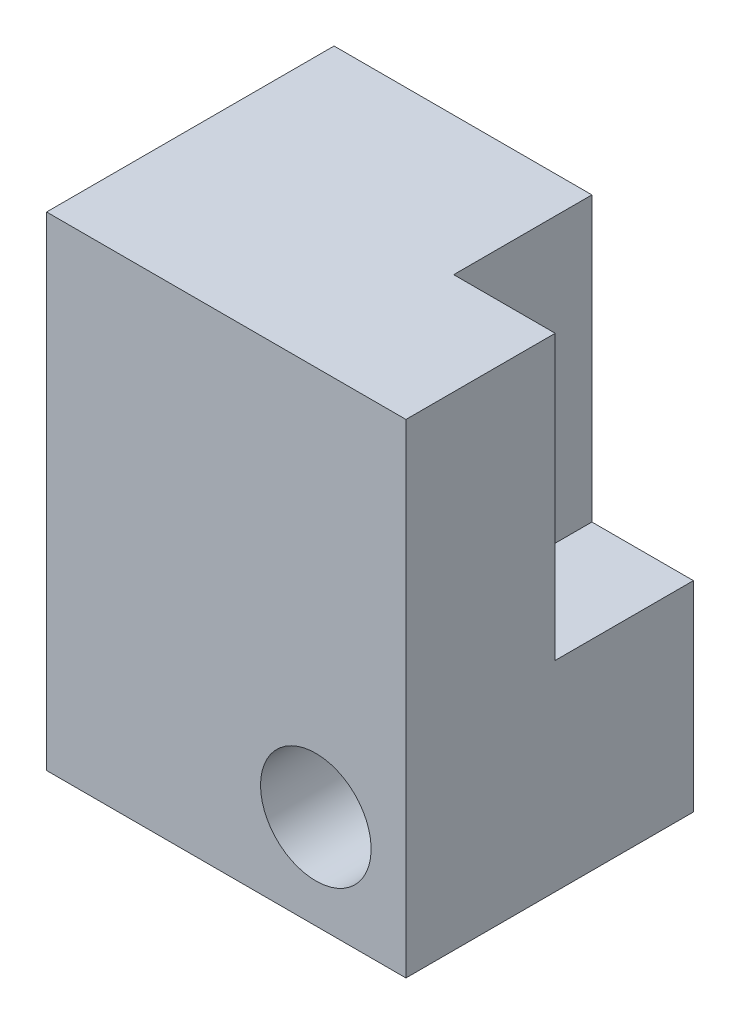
from build123d import *

# Parameters (mm, degrees)
SKETCH1_W           = 260
SKETCH1_H           = 350
SKETCH1_R           = 40
BOSS_EXTRUDE1_DEPTH = 104
SKETCH2_W           = 73.439684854
SKETCH2_H           = 100
CUT_EXTRUDE1_DEPTH  = 205


with BuildPart() as part:
    # Sketch1 → Boss-Extrude1 (new, symmetric)
    with BuildSketch(Plane.XY):
        Rectangle(SKETCH1_W, SKETCH1_H)
        with Locations(Location((64.79032116, -106.775086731, 0), (0, 0, 180))):
            Circle(SKETCH1_R, mode=Mode.SUBTRACT)
    extrude(amount=BOSS_EXTRUDE1_DEPTH, both=True)

    # Sketch2 → Cut-Extrude1 (cut)
    with BuildSketch(Plane(origin=(0, 175, 0), x_dir=(1, 0, 0), z_dir=(0, 1, 0))):
        with Locations((93.280157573, 54)):
            Rectangle(SKETCH2_W, SKETCH2_H)
    extrude(amount=-CUT_EXTRUDE1_DEPTH, mode=Mode.SUBTRACT)


solid = part.part
